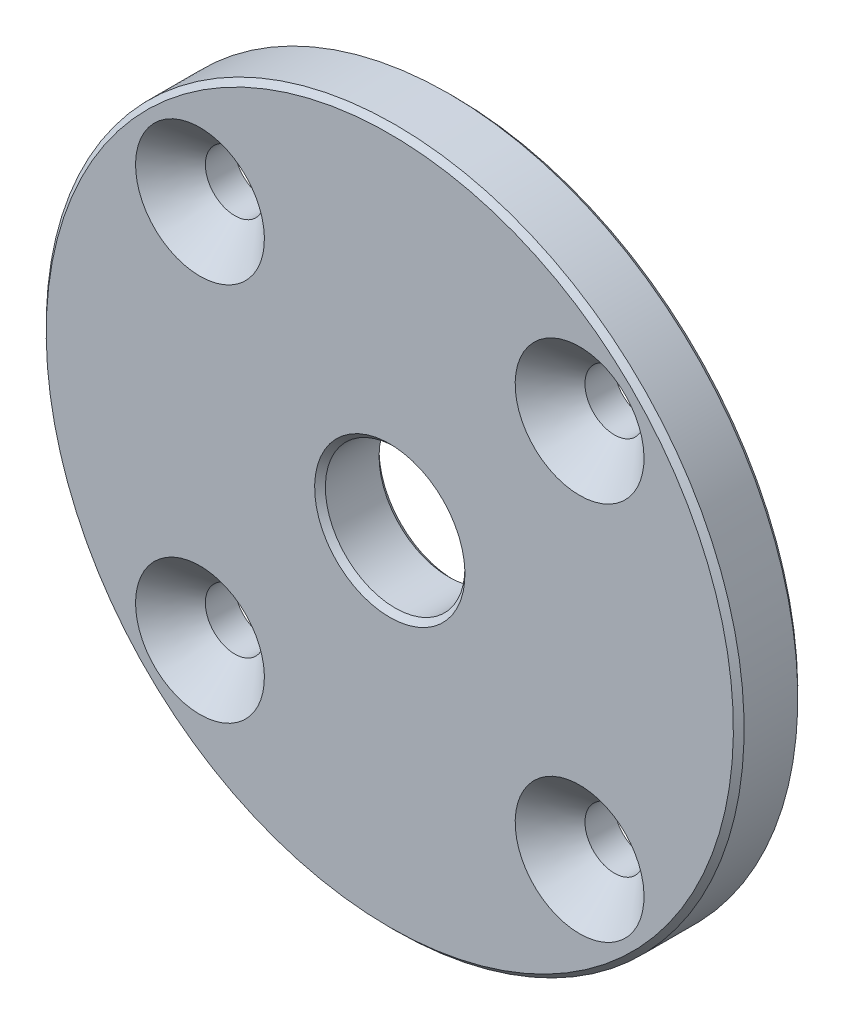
ISO-10303-21;
HEADER;
FILE_DESCRIPTION(('STEP AP214'),'2;1');
FILE_NAME('part.step','',(''),(''),'','','');
FILE_SCHEMA(('AUTOMOTIVE_DESIGN { 1 0 10303 214 1 1 1 1 }'));
ENDSEC;
DATA;
#1=APPLICATION_CONTEXT('core data for automotive mechanical design processes');
#2=APPLICATION_PROTOCOL_DEFINITION('international standard','automotive_design',2000,#1);
#3=PRODUCT_CONTEXT('',#1,'mechanical');
#4=PRODUCT('Part','Part','',(#3));
#5=PRODUCT_RELATED_PRODUCT_CATEGORY('part','',(#4));
#6=PRODUCT_DEFINITION_FORMATION('','',#4);
#7=PRODUCT_DEFINITION_CONTEXT('part definition',#1,'design');
#8=PRODUCT_DEFINITION('design','',#6,#7);
#9=PRODUCT_DEFINITION_SHAPE('','',#8);
#10=(LENGTH_UNIT() NAMED_UNIT(*) SI_UNIT(.MILLI.,.METRE.));
#11=(NAMED_UNIT(*) PLANE_ANGLE_UNIT() SI_UNIT($,.RADIAN.));
#12=(NAMED_UNIT(*) SI_UNIT($,.STERADIAN.) SOLID_ANGLE_UNIT());
#13=UNCERTAINTY_MEASURE_WITH_UNIT(LENGTH_MEASURE(1.E-05),#10,'distance_accuracy_value','');
#14=(GEOMETRIC_REPRESENTATION_CONTEXT(3) GLOBAL_UNCERTAINTY_ASSIGNED_CONTEXT((#13)) GLOBAL_UNIT_ASSIGNED_CONTEXT((#10,
#11,#12)) REPRESENTATION_CONTEXT('',''));
#15=CARTESIAN_POINT('',(0.,0.,0.));
#16=DIRECTION('',(0.,0.,1.));
#17=DIRECTION('',(1.,0.,0.));
#18=AXIS2_PLACEMENT_3D('',#15,#16,#17);
#19=CARTESIAN_POINT('',(6.5,0.,-6.));
#20=DIRECTION('',(0.,0.,-1.));
#21=DIRECTION('',(0.,1.,0.));
#22=AXIS2_PLACEMENT_3D('',#19,#20,#21);
#23=PLANE('',#22);
#24=CARTESIAN_POINT('',(0.,0.,-6.));
#25=DIRECTION('',(0.,0.,-1.));
#26=DIRECTION('',(0.,1.,0.));
#27=AXIS2_PLACEMENT_3D('',#24,#25,#26);
#28=CIRCLE('',#27,7.);
#29=CARTESIAN_POINT('',(0.,6.99999999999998,-6.00000000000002));
#30=VERTEX_POINT('',#29);
#31=EDGE_CURVE('E30',#30,#30,#28,.F.);
#32=ORIENTED_EDGE('',*,*,#31,.T.);
#33=EDGE_LOOP('',(#32));
#34=FACE_BOUND('',#33,.T.);
#35=CARTESIAN_POINT('',(-17.6776695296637,17.6776695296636,-6.));
#36=DIRECTION('',(0.,0.,-1.));
#37=DIRECTION('',(0.,1.,0.));
#38=AXIS2_PLACEMENT_3D('',#35,#36,#37);
#39=CIRCLE('',#38,2.75);
#40=CARTESIAN_POINT('',(-17.6776695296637,20.4276695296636,-6.00000000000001));
#41=VERTEX_POINT('',#40);
#42=EDGE_CURVE('E40',#41,#41,#39,.F.);
#43=ORIENTED_EDGE('',*,*,#42,.T.);
#44=EDGE_LOOP('',(#43));
#45=FACE_BOUND('',#44,.T.);
#46=CARTESIAN_POINT('',(17.6776695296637,-17.6776695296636,-6.));
#47=DIRECTION('',(0.,0.,-1.));
#48=DIRECTION('',(0.,1.,0.));
#49=AXIS2_PLACEMENT_3D('',#46,#47,#48);
#50=CIRCLE('',#49,2.75);
#51=CARTESIAN_POINT('',(17.6776695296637,-14.9276695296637,-6.00000000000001));
#52=VERTEX_POINT('',#51);
#53=EDGE_CURVE('E39',#52,#52,#50,.F.);
#54=ORIENTED_EDGE('',*,*,#53,.T.);
#55=EDGE_LOOP('',(#54));
#56=FACE_BOUND('',#55,.T.);
#57=CARTESIAN_POINT('',(0.,0.,-6.));
#58=DIRECTION('',(0.,0.,-1.));
#59=DIRECTION('',(0.,1.,0.));
#60=AXIS2_PLACEMENT_3D('',#57,#58,#59);
#61=CIRCLE('',#60,32.);
#62=CARTESIAN_POINT('',(0.,32.,-6.00000000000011));
#63=VERTEX_POINT('',#62);
#64=EDGE_CURVE('E35',#63,#63,#61,.T.);
#65=ORIENTED_EDGE('',*,*,#64,.T.);
#66=EDGE_LOOP('',(#65));
#67=FACE_BOUND('',#66,.T.);
#68=CARTESIAN_POINT('',(-17.6776695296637,-17.6776695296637,-6.));
#69=DIRECTION('',(0.,0.,-1.));
#70=DIRECTION('',(0.,1.,0.));
#71=AXIS2_PLACEMENT_3D('',#68,#69,#70);
#72=CIRCLE('',#71,2.75);
#73=CARTESIAN_POINT('',(-17.6776695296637,-14.9276695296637,-6.00000000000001));
#74=VERTEX_POINT('',#73);
#75=EDGE_CURVE('E36',#74,#74,#72,.F.);
#76=ORIENTED_EDGE('',*,*,#75,.T.);
#77=EDGE_LOOP('',(#76));
#78=FACE_BOUND('',#77,.T.);
#79=CARTESIAN_POINT('',(17.6776695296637,17.6776695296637,-6.));
#80=DIRECTION('',(0.,0.,-1.));
#81=DIRECTION('',(0.,1.,0.));
#82=AXIS2_PLACEMENT_3D('',#79,#80,#81);
#83=CIRCLE('',#82,2.75);
#84=CARTESIAN_POINT('',(17.6776695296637,20.4276695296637,-6.00000000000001));
#85=VERTEX_POINT('',#84);
#86=EDGE_CURVE('E43',#85,#85,#83,.F.);
#87=ORIENTED_EDGE('',*,*,#86,.T.);
#88=EDGE_LOOP('',(#87));
#89=FACE_BOUND('',#88,.T.);
#90=ADVANCED_FACE('F14',(#34,#45,#56,#67,#78,#89),#23,.T.);
#91=CARTESIAN_POINT('',(6.5,0.,0.));
#92=DIRECTION('',(0.,0.,1.));
#93=DIRECTION('',(0.,-1.,0.));
#94=AXIS2_PLACEMENT_3D('',#91,#92,#93);
#95=PLANE('',#94);
#96=CARTESIAN_POINT('',(0.,0.,0.));
#97=DIRECTION('',(0.,0.,1.));
#98=DIRECTION('',(0.,-1.,0.));
#99=AXIS2_PLACEMENT_3D('',#96,#97,#98);
#100=CIRCLE('',#99,7.);
#101=CARTESIAN_POINT('',(0.,-7.,0.));
#102=VERTEX_POINT('',#101);
#103=EDGE_CURVE('E9',#102,#102,#100,.F.);
#104=ORIENTED_EDGE('',*,*,#103,.T.);
#105=EDGE_LOOP('',(#104));
#106=FACE_BOUND('',#105,.T.);
#107=CARTESIAN_POINT('',(0.,0.,0.));
#108=DIRECTION('',(0.,0.,1.));
#109=DIRECTION('',(0.,-1.,0.));
#110=AXIS2_PLACEMENT_3D('',#107,#108,#109);
#111=CIRCLE('',#110,32.);
#112=CARTESIAN_POINT('',(0.,-32.,1.1172740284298E-13));
#113=VERTEX_POINT('',#112);
#114=EDGE_CURVE('E57',#113,#113,#111,.T.);
#115=ORIENTED_EDGE('',*,*,#114,.T.);
#116=EDGE_LOOP('',(#115));
#117=FACE_BOUND('',#116,.T.);
#118=CARTESIAN_POINT('',(-17.6776695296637,17.6776695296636,0.));
#119=DIRECTION('',(0.,0.,1.));
#120=DIRECTION('',(0.,-1.,0.));
#121=AXIS2_PLACEMENT_3D('',#118,#119,#120);
#122=CIRCLE('',#121,6.);
#123=CARTESIAN_POINT('',(-17.6776695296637,11.6776695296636,0.));
#124=VERTEX_POINT('',#123);
#125=EDGE_CURVE('E63',#124,#124,#122,.T.);
#126=ORIENTED_EDGE('',*,*,#125,.F.);
#127=EDGE_LOOP('',(#126));
#128=FACE_BOUND('',#127,.T.);
#129=CARTESIAN_POINT('',(-17.6776695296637,-17.6776695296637,0.));
#130=DIRECTION('',(0.,0.,1.));
#131=DIRECTION('',(0.,-1.,0.));
#132=AXIS2_PLACEMENT_3D('',#129,#130,#131);
#133=CIRCLE('',#132,6.);
#134=CARTESIAN_POINT('',(-17.6776695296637,-23.6776695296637,0.));
#135=VERTEX_POINT('',#134);
#136=EDGE_CURVE('E69',#135,#135,#133,.T.);
#137=ORIENTED_EDGE('',*,*,#136,.F.);
#138=EDGE_LOOP('',(#137));
#139=FACE_BOUND('',#138,.T.);
#140=CARTESIAN_POINT('',(17.6776695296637,-17.6776695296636,0.));
#141=DIRECTION('',(0.,0.,1.));
#142=DIRECTION('',(0.,-1.,0.));
#143=AXIS2_PLACEMENT_3D('',#140,#141,#142);
#144=CIRCLE('',#143,6.);
#145=CARTESIAN_POINT('',(17.6776695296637,-23.6776695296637,0.));
#146=VERTEX_POINT('',#145);
#147=EDGE_CURVE('E75',#146,#146,#144,.T.);
#148=ORIENTED_EDGE('',*,*,#147,.F.);
#149=EDGE_LOOP('',(#148));
#150=FACE_BOUND('',#149,.T.);
#151=CARTESIAN_POINT('',(17.6776695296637,17.6776695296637,0.));
#152=DIRECTION('',(0.,0.,1.));
#153=DIRECTION('',(0.,-1.,0.));
#154=AXIS2_PLACEMENT_3D('',#151,#152,#153);
#155=CIRCLE('',#154,6.);
#156=CARTESIAN_POINT('',(17.6776695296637,11.6776695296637,0.));
#157=VERTEX_POINT('',#156);
#158=EDGE_CURVE('E48',#157,#157,#155,.T.);
#159=ORIENTED_EDGE('',*,*,#158,.F.);
#160=EDGE_LOOP('',(#159));
#161=FACE_BOUND('',#160,.T.);
#162=ADVANCED_FACE('F86',(#106,#117,#128,#139,#150,#161),#95,.T.);
#163=CARTESIAN_POINT('',(0.,0.,0.));
#164=DIRECTION('',(0.,0.,1.));
#165=DIRECTION('',(0.,-1.,0.));
#166=AXIS2_PLACEMENT_3D('',#163,#164,#165);
#167=CYLINDRICAL_SURFACE('',#166,32.5);
#168=CARTESIAN_POINT('',(0.,0.,-0.500000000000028));
#169=DIRECTION('',(0.,0.,1.));
#170=DIRECTION('',(0.,-1.,0.));
#171=AXIS2_PLACEMENT_3D('',#168,#169,#170);
#172=CIRCLE('',#171,32.5);
#173=CARTESIAN_POINT('',(0.,-32.5,-0.499999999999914));
#174=VERTEX_POINT('',#173);
#175=EDGE_CURVE('E51',#174,#174,#172,.F.);
#176=ORIENTED_EDGE('',*,*,#175,.T.);
#177=EDGE_LOOP('',(#176));
#178=FACE_BOUND('',#177,.T.);
#179=CARTESIAN_POINT('',(0.,0.,-5.5));
#180=DIRECTION('',(0.,0.,-1.));
#181=DIRECTION('',(0.,1.,0.));
#182=AXIS2_PLACEMENT_3D('',#179,#180,#181);
#183=CIRCLE('',#182,32.5);
#184=CARTESIAN_POINT('',(0.,32.5,-5.50000000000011));
#185=VERTEX_POINT('',#184);
#186=EDGE_CURVE('E54',#185,#185,#183,.F.);
#187=ORIENTED_EDGE('',*,*,#186,.T.);
#188=EDGE_LOOP('',(#187));
#189=FACE_BOUND('',#188,.T.);
#190=ADVANCED_FACE('F88',(#178,#189),#167,.T.);
#191=CARTESIAN_POINT('',(0.,0.,0.));
#192=DIRECTION('',(0.,0.,-1.));
#193=DIRECTION('',(0.,1.,0.));
#194=AXIS2_PLACEMENT_3D('',#191,#192,#193);
#195=CONICAL_SURFACE('',#194,32.,0.785398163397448);
#196=ORIENTED_EDGE('',*,*,#175,.F.);
#197=EDGE_LOOP('',(#196));
#198=FACE_BOUND('',#197,.T.);
#199=ORIENTED_EDGE('',*,*,#114,.F.);
#200=EDGE_LOOP('',(#199));
#201=FACE_BOUND('',#200,.T.);
#202=ADVANCED_FACE('F96',(#198,#201),#195,.T.);
#203=CARTESIAN_POINT('',(0.,0.,-5.5));
#204=DIRECTION('',(0.,0.,1.));
#205=DIRECTION('',(0.,-1.,0.));
#206=AXIS2_PLACEMENT_3D('',#203,#204,#205);
#207=CONICAL_SURFACE('',#206,32.5,0.785398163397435);
#208=ORIENTED_EDGE('',*,*,#64,.F.);
#209=EDGE_LOOP('',(#208));
#210=FACE_BOUND('',#209,.T.);
#211=ORIENTED_EDGE('',*,*,#186,.F.);
#212=EDGE_LOOP('',(#211));
#213=FACE_BOUND('',#212,.T.);
#214=ADVANCED_FACE('F108',(#210,#213),#207,.T.);
#215=CARTESIAN_POINT('',(-17.6776695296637,17.6776695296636,0.));
#216=DIRECTION('',(0.,0.,1.));
#217=DIRECTION('',(0.,-1.,0.));
#218=AXIS2_PLACEMENT_3D('',#215,#216,#217);
#219=CYLINDRICAL_SURFACE('',#218,2.75);
#220=CARTESIAN_POINT('',(-17.6776695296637,17.6776695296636,-3.25000000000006));
#221=DIRECTION('',(0.,0.,1.));
#222=DIRECTION('',(0.,-1.,0.));
#223=AXIS2_PLACEMENT_3D('',#220,#221,#222);
#224=CIRCLE('',#223,2.75);
#225=CARTESIAN_POINT('',(-17.6776695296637,14.9276695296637,-3.25000000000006));
#226=VERTEX_POINT('',#225);
#227=EDGE_CURVE('E60',#226,#226,#224,.T.);
#228=ORIENTED_EDGE('',*,*,#227,.T.);
#229=EDGE_LOOP('',(#228));
#230=FACE_BOUND('',#229,.T.);
#231=ORIENTED_EDGE('',*,*,#42,.F.);
#232=EDGE_LOOP('',(#231));
#233=FACE_BOUND('',#232,.T.);
#234=ADVANCED_FACE('F112',(#230,#233),#219,.F.);
#235=CARTESIAN_POINT('',(-17.6776695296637,17.6776695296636,0.));
#236=DIRECTION('',(0.,0.,1.));
#237=DIRECTION('',(0.,-1.,0.));
#238=AXIS2_PLACEMENT_3D('',#235,#236,#237);
#239=CONICAL_SURFACE('',#238,6.,0.785398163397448);
#240=ORIENTED_EDGE('',*,*,#227,.F.);
#241=EDGE_LOOP('',(#240));
#242=FACE_BOUND('',#241,.T.);
#243=ORIENTED_EDGE('',*,*,#125,.T.);
#244=EDGE_LOOP('',(#243));
#245=FACE_BOUND('',#244,.T.);
#246=ADVANCED_FACE('F103',(#242,#245),#239,.F.);
#247=CARTESIAN_POINT('',(-17.6776695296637,-17.6776695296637,0.));
#248=DIRECTION('',(0.,0.,1.));
#249=DIRECTION('',(0.,-1.,0.));
#250=AXIS2_PLACEMENT_3D('',#247,#248,#249);
#251=CYLINDRICAL_SURFACE('',#250,2.75);
#252=CARTESIAN_POINT('',(-17.6776695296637,-17.6776695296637,-3.24999999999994));
#253=DIRECTION('',(0.,0.,1.));
#254=DIRECTION('',(0.,-1.,0.));
#255=AXIS2_PLACEMENT_3D('',#252,#253,#254);
#256=CIRCLE('',#255,2.75);
#257=CARTESIAN_POINT('',(-17.6776695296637,-20.4276695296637,-3.24999999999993));
#258=VERTEX_POINT('',#257);
#259=EDGE_CURVE('E66',#258,#258,#256,.T.);
#260=ORIENTED_EDGE('',*,*,#259,.T.);
#261=EDGE_LOOP('',(#260));
#262=FACE_BOUND('',#261,.T.);
#263=ORIENTED_EDGE('',*,*,#75,.F.);
#264=EDGE_LOOP('',(#263));
#265=FACE_BOUND('',#264,.T.);
#266=ADVANCED_FACE('F124',(#262,#265),#251,.F.);
#267=CARTESIAN_POINT('',(-17.6776695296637,-17.6776695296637,0.));
#268=DIRECTION('',(0.,0.,1.));
#269=DIRECTION('',(0.,-1.,0.));
#270=AXIS2_PLACEMENT_3D('',#267,#268,#269);
#271=CONICAL_SURFACE('',#270,6.,0.785398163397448);
#272=ORIENTED_EDGE('',*,*,#259,.F.);
#273=EDGE_LOOP('',(#272));
#274=FACE_BOUND('',#273,.T.);
#275=ORIENTED_EDGE('',*,*,#136,.T.);
#276=EDGE_LOOP('',(#275));
#277=FACE_BOUND('',#276,.T.);
#278=ADVANCED_FACE('F122',(#274,#277),#271,.F.);
#279=CARTESIAN_POINT('',(17.6776695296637,-17.6776695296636,0.));
#280=DIRECTION('',(0.,0.,1.));
#281=DIRECTION('',(0.,-1.,0.));
#282=AXIS2_PLACEMENT_3D('',#279,#280,#281);
#283=CYLINDRICAL_SURFACE('',#282,2.75);
#284=CARTESIAN_POINT('',(17.6776695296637,-17.6776695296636,-3.24999999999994));
#285=DIRECTION('',(0.,0.,1.));
#286=DIRECTION('',(0.,-1.,0.));
#287=AXIS2_PLACEMENT_3D('',#284,#285,#286);
#288=CIRCLE('',#287,2.75);
#289=CARTESIAN_POINT('',(17.6776695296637,-20.4276695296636,-3.24999999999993));
#290=VERTEX_POINT('',#289);
#291=EDGE_CURVE('E72',#290,#290,#288,.T.);
#292=ORIENTED_EDGE('',*,*,#291,.T.);
#293=EDGE_LOOP('',(#292));
#294=FACE_BOUND('',#293,.T.);
#295=ORIENTED_EDGE('',*,*,#53,.F.);
#296=EDGE_LOOP('',(#295));
#297=FACE_BOUND('',#296,.T.);
#298=ADVANCED_FACE('F118',(#294,#297),#283,.F.);
#299=CARTESIAN_POINT('',(17.6776695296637,-17.6776695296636,0.));
#300=DIRECTION('',(0.,0.,1.));
#301=DIRECTION('',(0.,-1.,0.));
#302=AXIS2_PLACEMENT_3D('',#299,#300,#301);
#303=CONICAL_SURFACE('',#302,6.,0.785398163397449);
#304=ORIENTED_EDGE('',*,*,#291,.F.);
#305=EDGE_LOOP('',(#304));
#306=FACE_BOUND('',#305,.T.);
#307=ORIENTED_EDGE('',*,*,#147,.T.);
#308=EDGE_LOOP('',(#307));
#309=FACE_BOUND('',#308,.T.);
#310=ADVANCED_FACE('F121',(#306,#309),#303,.F.);
#311=CARTESIAN_POINT('',(17.6776695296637,17.6776695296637,0.));
#312=DIRECTION('',(0.,0.,1.));
#313=DIRECTION('',(0.,-1.,0.));
#314=AXIS2_PLACEMENT_3D('',#311,#312,#313);
#315=CYLINDRICAL_SURFACE('',#314,2.75);
#316=CARTESIAN_POINT('',(17.6776695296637,17.6776695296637,-3.25000000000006));
#317=DIRECTION('',(0.,0.,1.));
#318=DIRECTION('',(0.,-1.,0.));
#319=AXIS2_PLACEMENT_3D('',#316,#317,#318);
#320=CIRCLE('',#319,2.75);
#321=CARTESIAN_POINT('',(17.6776695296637,14.9276695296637,-3.25000000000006));
#322=VERTEX_POINT('',#321);
#323=EDGE_CURVE('E78',#322,#322,#320,.T.);
#324=ORIENTED_EDGE('',*,*,#323,.T.);
#325=EDGE_LOOP('',(#324));
#326=FACE_BOUND('',#325,.T.);
#327=ORIENTED_EDGE('',*,*,#86,.F.);
#328=EDGE_LOOP('',(#327));
#329=FACE_BOUND('',#328,.T.);
#330=ADVANCED_FACE('F131',(#326,#329),#315,.F.);
#331=CARTESIAN_POINT('',(17.6776695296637,17.6776695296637,0.));
#332=DIRECTION('',(0.,0.,1.));
#333=DIRECTION('',(0.,-1.,0.));
#334=AXIS2_PLACEMENT_3D('',#331,#332,#333);
#335=CONICAL_SURFACE('',#334,6.,0.785398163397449);
#336=ORIENTED_EDGE('',*,*,#323,.F.);
#337=EDGE_LOOP('',(#336));
#338=FACE_BOUND('',#337,.T.);
#339=ORIENTED_EDGE('',*,*,#158,.T.);
#340=EDGE_LOOP('',(#339));
#341=FACE_BOUND('',#340,.T.);
#342=ADVANCED_FACE('F84',(#338,#341),#335,.F.);
#343=CARTESIAN_POINT('',(0.,0.,0.));
#344=DIRECTION('',(0.,0.,1.));
#345=DIRECTION('',(0.,-1.,0.));
#346=AXIS2_PLACEMENT_3D('',#343,#344,#345);
#347=CYLINDRICAL_SURFACE('',#346,6.5);
#348=CARTESIAN_POINT('',(0.,0.,-5.5));
#349=DIRECTION('',(0.,0.,-1.));
#350=DIRECTION('',(0.,1.,0.));
#351=AXIS2_PLACEMENT_3D('',#348,#349,#350);
#352=CIRCLE('',#351,6.5);
#353=CARTESIAN_POINT('',(0.,6.49999999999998,-5.50000000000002));
#354=VERTEX_POINT('',#353);
#355=EDGE_CURVE('E22',#354,#354,#352,.T.);
#356=ORIENTED_EDGE('',*,*,#355,.T.);
#357=EDGE_LOOP('',(#356));
#358=FACE_BOUND('',#357,.T.);
#359=CARTESIAN_POINT('',(0.,0.,-0.500000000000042));
#360=DIRECTION('',(0.,0.,1.));
#361=DIRECTION('',(0.,-1.,0.));
#362=AXIS2_PLACEMENT_3D('',#359,#360,#361);
#363=CIRCLE('',#362,6.5);
#364=CARTESIAN_POINT('',(0.,-6.5,-0.500000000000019));
#365=VERTEX_POINT('',#364);
#366=EDGE_CURVE('E26',#365,#365,#363,.T.);
#367=ORIENTED_EDGE('',*,*,#366,.T.);
#368=EDGE_LOOP('',(#367));
#369=FACE_BOUND('',#368,.T.);
#370=ADVANCED_FACE('F114',(#358,#369),#347,.F.);
#371=CARTESIAN_POINT('',(0.,0.,-6.));
#372=DIRECTION('',(0.,0.,-1.));
#373=DIRECTION('',(0.,1.,0.));
#374=AXIS2_PLACEMENT_3D('',#371,#372,#373);
#375=CONICAL_SURFACE('',#374,7.,0.785398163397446);
#376=ORIENTED_EDGE('',*,*,#355,.F.);
#377=EDGE_LOOP('',(#376));
#378=FACE_BOUND('',#377,.T.);
#379=ORIENTED_EDGE('',*,*,#31,.F.);
#380=EDGE_LOOP('',(#379));
#381=FACE_BOUND('',#380,.T.);
#382=ADVANCED_FACE('F117',(#378,#381),#375,.F.);
#383=CARTESIAN_POINT('',(0.,0.,0.));
#384=DIRECTION('',(0.,0.,1.));
#385=DIRECTION('',(0.,-1.,0.));
#386=AXIS2_PLACEMENT_3D('',#383,#384,#385);
#387=CONICAL_SURFACE('',#386,7.,0.78539816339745);
#388=ORIENTED_EDGE('',*,*,#366,.F.);
#389=EDGE_LOOP('',(#388));
#390=FACE_BOUND('',#389,.T.);
#391=ORIENTED_EDGE('',*,*,#103,.F.);
#392=EDGE_LOOP('',(#391));
#393=FACE_BOUND('',#392,.T.);
#394=ADVANCED_FACE('F17',(#390,#393),#387,.F.);
#395=CLOSED_SHELL('',(#90,#162,#190,#202,#214,#234,#246,#266,#278,#298,#310,#330,#342,#370,#382,#394));
#396=MANIFOLD_SOLID_BREP('B1',#395);
#397=ADVANCED_BREP_SHAPE_REPRESENTATION('',(#18,#396),#14);
#398=SHAPE_DEFINITION_REPRESENTATION(#9,#397);
ENDSEC;
END-ISO-10303-21;
